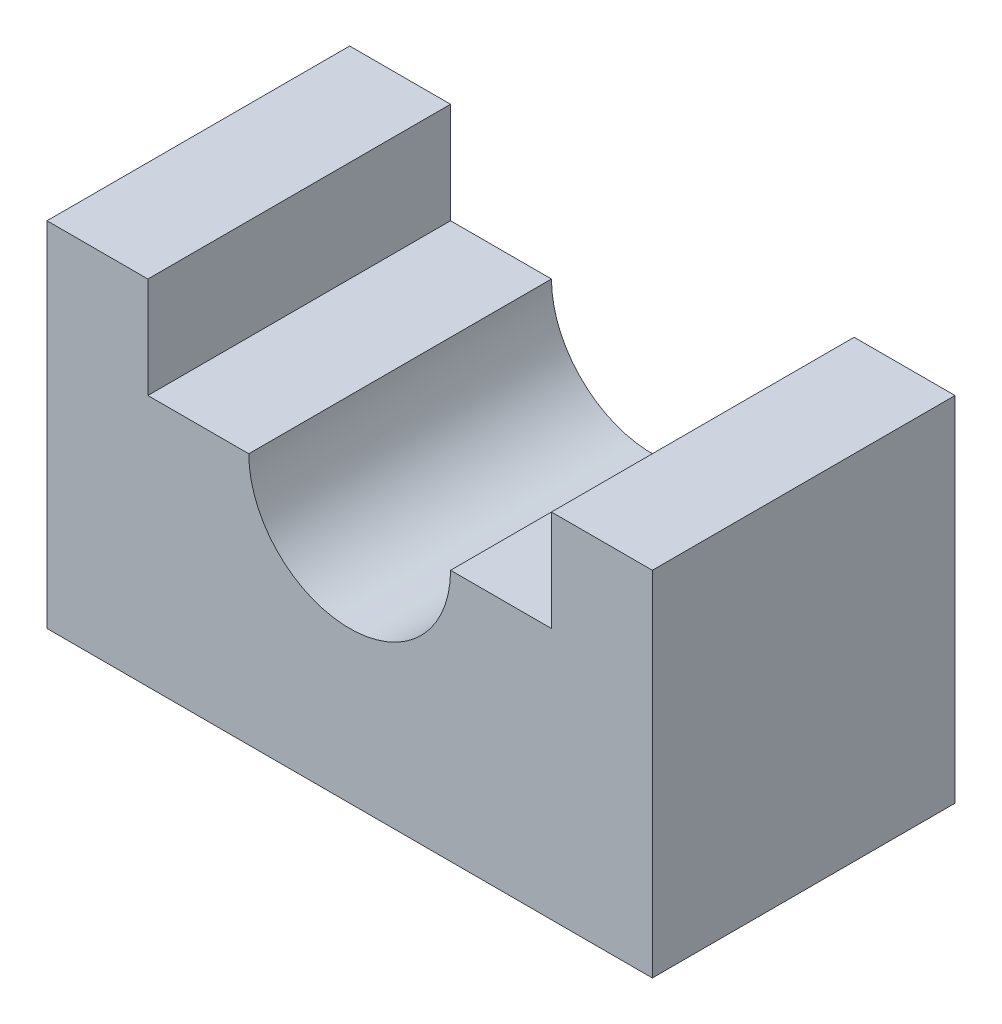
from build123d import *

# Parameters (mm, degrees)
BOSS_EXTRUDE1_DEPTH = 30


with BuildPart() as part:
    # Sketch1 → Boss-Extrude1 (new body)
    with BuildSketch(Plane.XY):
        with BuildLine():
            Line((0, 0), (60, 0))
            Line((60, 0), (60, 35))
            Line((60, 35), (50, 35))
            Line((50, 35), (50, 25))
            Line((50, 25), (40, 25))
            ThreePointArc((40, 25), (30, 15), (20, 25))
            Line((20, 25), (10, 25))
            Line((10, 25), (10, 35))
            Line((10, 35), (0, 35))
            Line((0, 35), (0, 0))
        make_face()
    extrude(amount=BOSS_EXTRUDE1_DEPTH)


solid = part.part
